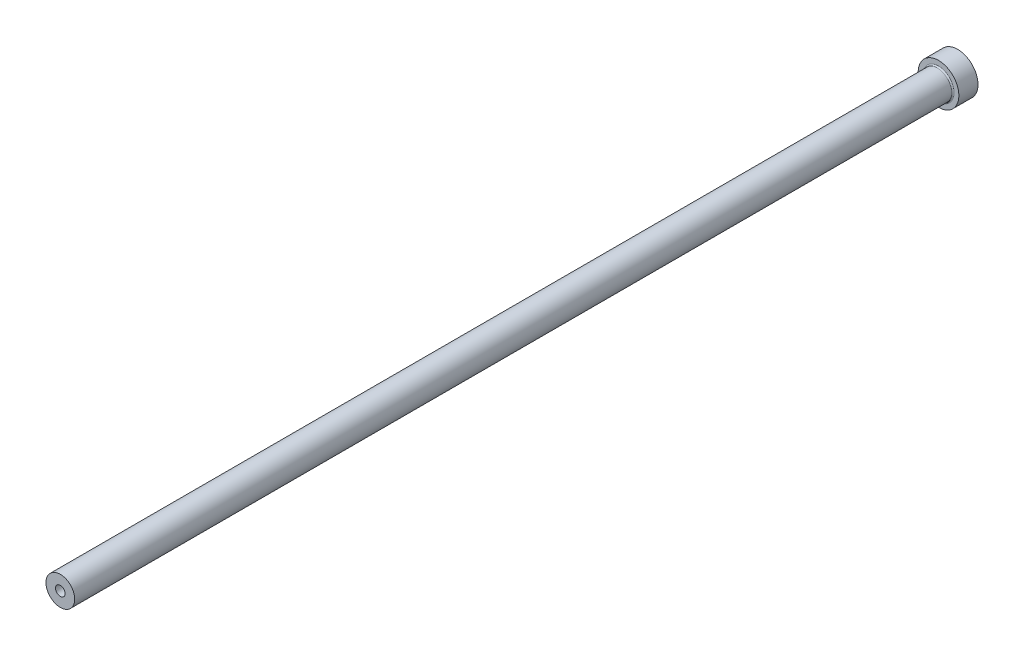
ISO-10303-21;
HEADER;
FILE_DESCRIPTION(('STEP AP214'),'2;1');
FILE_NAME('part.step','',(''),(''),'','','');
FILE_SCHEMA(('AUTOMOTIVE_DESIGN { 1 0 10303 214 1 1 1 1 }'));
ENDSEC;
DATA;
#1=APPLICATION_CONTEXT('core data for automotive mechanical design processes');
#2=APPLICATION_PROTOCOL_DEFINITION('international standard','automotive_design',2000,#1);
#3=PRODUCT_CONTEXT('',#1,'mechanical');
#4=PRODUCT('Part','Part','',(#3));
#5=PRODUCT_RELATED_PRODUCT_CATEGORY('part','',(#4));
#6=PRODUCT_DEFINITION_FORMATION('','',#4);
#7=PRODUCT_DEFINITION_CONTEXT('part definition',#1,'design');
#8=PRODUCT_DEFINITION('design','',#6,#7);
#9=PRODUCT_DEFINITION_SHAPE('','',#8);
#10=(LENGTH_UNIT() NAMED_UNIT(*) SI_UNIT(.MILLI.,.METRE.));
#11=(NAMED_UNIT(*) PLANE_ANGLE_UNIT() SI_UNIT($,.RADIAN.));
#12=(NAMED_UNIT(*) SI_UNIT($,.STERADIAN.) SOLID_ANGLE_UNIT());
#13=UNCERTAINTY_MEASURE_WITH_UNIT(LENGTH_MEASURE(1.E-05),#10,'distance_accuracy_value','');
#14=(GEOMETRIC_REPRESENTATION_CONTEXT(3) GLOBAL_UNCERTAINTY_ASSIGNED_CONTEXT((#13)) GLOBAL_UNIT_ASSIGNED_CONTEXT((#10,
#11,#12)) REPRESENTATION_CONTEXT('',''));
#15=CARTESIAN_POINT('',(0.,0.,0.));
#16=DIRECTION('',(0.,0.,1.));
#17=DIRECTION('',(1.,0.,0.));
#18=AXIS2_PLACEMENT_3D('',#15,#16,#17);
#19=CARTESIAN_POINT('',(0.,0.,375.));
#20=DIRECTION('',(0.,0.,-1.));
#21=DIRECTION('',(-1.,0.,0.));
#22=AXIS2_PLACEMENT_3D('',#19,#20,#21);
#23=PLANE('',#22);
#24=CARTESIAN_POINT('',(0.,0.,375.));
#25=DIRECTION('',(0.,0.,1.));
#26=DIRECTION('',(1.,0.,0.));
#27=AXIS2_PLACEMENT_3D('',#24,#25,#26);
#28=CIRCLE('',#27,1.99999999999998);
#29=CARTESIAN_POINT('',(1.99999999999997,0.,375.));
#30=VERTEX_POINT('',#29);
#31=EDGE_CURVE('E63',#30,#30,#28,.T.);
#32=ORIENTED_EDGE('',*,*,#31,.F.);
#33=EDGE_LOOP('',(#32));
#34=FACE_BOUND('',#33,.T.);
#35=CARTESIAN_POINT('',(0.,0.,375.));
#36=DIRECTION('',(0.,0.,1.));
#37=DIRECTION('',(1.,0.,0.));
#38=AXIS2_PLACEMENT_3D('',#35,#36,#37);
#39=CIRCLE('',#38,5.99999999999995);
#40=CARTESIAN_POINT('',(5.99999999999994,0.,375.));
#41=VERTEX_POINT('',#40);
#42=EDGE_CURVE('E54',#41,#41,#39,.T.);
#43=ORIENTED_EDGE('',*,*,#42,.T.);
#44=EDGE_LOOP('',(#43));
#45=FACE_BOUND('',#44,.T.);
#46=ADVANCED_FACE('F34',(#34,#45),#23,.F.);
#47=CARTESIAN_POINT('',(0.,0.,375.));
#48=DIRECTION('',(0.,0.,1.));
#49=DIRECTION('',(1.,0.,0.));
#50=AXIS2_PLACEMENT_3D('',#47,#48,#49);
#51=CYLINDRICAL_SURFACE('',#50,5.99999999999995);
#52=CARTESIAN_POINT('',(0.,0.,8.50000000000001));
#53=DIRECTION('',(0.,0.,1.));
#54=DIRECTION('',(1.,0.,0.));
#55=AXIS2_PLACEMENT_3D('',#52,#53,#54);
#56=CIRCLE('',#55,5.99999999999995);
#57=CARTESIAN_POINT('',(5.99999999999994,0.,8.50000000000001));
#58=VERTEX_POINT('',#57);
#59=EDGE_CURVE('E49',#58,#58,#56,.T.);
#60=ORIENTED_EDGE('',*,*,#59,.T.);
#61=EDGE_LOOP('',(#60));
#62=FACE_BOUND('',#61,.T.);
#63=ORIENTED_EDGE('',*,*,#42,.F.);
#64=EDGE_LOOP('',(#63));
#65=FACE_BOUND('',#64,.T.);
#66=ADVANCED_FACE('F92',(#62,#65),#51,.T.);
#67=CARTESIAN_POINT('',(0.,0.,8.));
#68=DIRECTION('',(0.,0.,1.));
#69=DIRECTION('',(1.,0.,0.));
#70=AXIS2_PLACEMENT_3D('',#67,#68,#69);
#71=PLANE('',#70);
#72=CARTESIAN_POINT('',(0.,0.,8.));
#73=DIRECTION('',(0.,0.,1.));
#74=DIRECTION('',(1.,0.,0.));
#75=AXIS2_PLACEMENT_3D('',#72,#73,#74);
#76=CIRCLE('',#75,6.49999999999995);
#77=CARTESIAN_POINT('',(6.49999999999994,0.,8.));
#78=VERTEX_POINT('',#77);
#79=EDGE_CURVE('E45',#78,#78,#76,.F.);
#80=ORIENTED_EDGE('',*,*,#79,.T.);
#81=EDGE_LOOP('',(#80));
#82=FACE_BOUND('',#81,.T.);
#83=CARTESIAN_POINT('',(0.,0.,8.00000000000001));
#84=DIRECTION('',(0.,0.,1.));
#85=DIRECTION('',(1.,0.,0.));
#86=AXIS2_PLACEMENT_3D('',#83,#84,#85);
#87=CIRCLE('',#86,8.49999999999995);
#88=CARTESIAN_POINT('',(8.49999999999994,0.,8.00000000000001));
#89=VERTEX_POINT('',#88);
#90=EDGE_CURVE('E57',#89,#89,#87,.T.);
#91=ORIENTED_EDGE('',*,*,#90,.T.);
#92=EDGE_LOOP('',(#91));
#93=FACE_BOUND('',#92,.T.);
#94=ADVANCED_FACE('F98',(#82,#93),#71,.T.);
#95=CARTESIAN_POINT('',(0.,0.,375.));
#96=DIRECTION('',(0.,0.,1.));
#97=DIRECTION('',(1.,0.,0.));
#98=AXIS2_PLACEMENT_3D('',#95,#96,#97);
#99=CYLINDRICAL_SURFACE('',#98,8.49999999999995);
#100=ORIENTED_EDGE('',*,*,#90,.F.);
#101=EDGE_LOOP('',(#100));
#102=FACE_BOUND('',#101,.T.);
#103=CARTESIAN_POINT('',(0.,0.,0.));
#104=DIRECTION('',(0.,0.,1.));
#105=DIRECTION('',(1.,0.,0.));
#106=AXIS2_PLACEMENT_3D('',#103,#104,#105);
#107=CIRCLE('',#106,8.49999999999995);
#108=CARTESIAN_POINT('',(8.49999999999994,0.,0.));
#109=VERTEX_POINT('',#108);
#110=EDGE_CURVE('E60',#109,#109,#107,.T.);
#111=ORIENTED_EDGE('',*,*,#110,.T.);
#112=EDGE_LOOP('',(#111));
#113=FACE_BOUND('',#112,.T.);
#114=ADVANCED_FACE('F89',(#102,#113),#99,.T.);
#115=CARTESIAN_POINT('',(0.,0.,0.));
#116=DIRECTION('',(0.,0.,1.));
#117=DIRECTION('',(1.,0.,0.));
#118=AXIS2_PLACEMENT_3D('',#115,#116,#117);
#119=PLANE('',#118);
#120=CARTESIAN_POINT('',(0.,0.,0.));
#121=DIRECTION('',(0.,0.,1.));
#122=DIRECTION('',(1.,0.,0.));
#123=AXIS2_PLACEMENT_3D('',#120,#121,#122);
#124=CIRCLE('',#123,2.75000000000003);
#125=CARTESIAN_POINT('',(2.74999999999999,0.,0.));
#126=VERTEX_POINT('',#125);
#127=EDGE_CURVE('E41',#126,#126,#124,.T.);
#128=ORIENTED_EDGE('',*,*,#127,.T.);
#129=EDGE_LOOP('',(#128));
#130=FACE_BOUND('',#129,.T.);
#131=ORIENTED_EDGE('',*,*,#110,.F.);
#132=EDGE_LOOP('',(#131));
#133=FACE_BOUND('',#132,.T.);
#134=ADVANCED_FACE('F83',(#130,#133),#119,.F.);
#135=CARTESIAN_POINT('',(0.,0.,375.));
#136=DIRECTION('',(0.,0.,1.));
#137=DIRECTION('',(1.,0.,0.));
#138=AXIS2_PLACEMENT_3D('',#135,#136,#137);
#139=CYLINDRICAL_SURFACE('',#138,1.99999999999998);
#140=ORIENTED_EDGE('',*,*,#31,.T.);
#141=EDGE_LOOP('',(#140));
#142=FACE_BOUND('',#141,.T.);
#143=CARTESIAN_POINT('',(0.,0.,225.));
#144=DIRECTION('',(0.,0.,1.));
#145=DIRECTION('',(1.,0.,0.));
#146=AXIS2_PLACEMENT_3D('',#143,#144,#145);
#147=CIRCLE('',#146,1.99999999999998);
#148=CARTESIAN_POINT('',(1.99999999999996,0.,225.));
#149=VERTEX_POINT('',#148);
#150=EDGE_CURVE('E66',#149,#149,#147,.T.);
#151=ORIENTED_EDGE('',*,*,#150,.F.);
#152=EDGE_LOOP('',(#151));
#153=FACE_BOUND('',#152,.T.);
#154=ADVANCED_FACE('F78',(#142,#153),#139,.F.);
#155=CARTESIAN_POINT('',(0.,0.,225.));
#156=DIRECTION('',(0.,0.,-1.));
#157=DIRECTION('',(-1.,0.,0.));
#158=AXIS2_PLACEMENT_3D('',#155,#156,#157);
#159=CONICAL_SURFACE('',#158,1.99999999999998,0.523598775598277);
#160=CARTESIAN_POINT('',(0.,0.,224.566987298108));
#161=DIRECTION('',(0.,0.,1.));
#162=DIRECTION('',(1.,0.,0.));
#163=AXIS2_PLACEMENT_3D('',#160,#161,#162);
#164=CIRCLE('',#163,2.24999999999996);
#165=CARTESIAN_POINT('',(2.24999999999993,0.,224.566987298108));
#166=VERTEX_POINT('',#165);
#167=EDGE_CURVE('E69',#166,#166,#164,.T.);
#168=ORIENTED_EDGE('',*,*,#167,.F.);
#169=EDGE_LOOP('',(#168));
#170=FACE_BOUND('',#169,.T.);
#171=ORIENTED_EDGE('',*,*,#150,.T.);
#172=EDGE_LOOP('',(#171));
#173=FACE_BOUND('',#172,.T.);
#174=ADVANCED_FACE('F75',(#170,#173),#159,.F.);
#175=CARTESIAN_POINT('',(0.,0.,375.));
#176=DIRECTION('',(0.,0.,1.));
#177=DIRECTION('',(1.,0.,0.));
#178=AXIS2_PLACEMENT_3D('',#175,#176,#177);
#179=CYLINDRICAL_SURFACE('',#178,2.24999999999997);
#180=CARTESIAN_POINT('',(0.,0.,0.500000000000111));
#181=DIRECTION('',(0.,0.,1.));
#182=DIRECTION('',(1.,0.,0.));
#183=AXIS2_PLACEMENT_3D('',#180,#181,#182);
#184=CIRCLE('',#183,2.24999999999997);
#185=CARTESIAN_POINT('',(2.24999999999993,0.,0.500000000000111));
#186=VERTEX_POINT('',#185);
#187=EDGE_CURVE('E10',#186,#186,#184,.F.);
#188=ORIENTED_EDGE('',*,*,#187,.T.);
#189=EDGE_LOOP('',(#188));
#190=FACE_BOUND('',#189,.T.);
#191=ORIENTED_EDGE('',*,*,#167,.T.);
#192=EDGE_LOOP('',(#191));
#193=FACE_BOUND('',#192,.T.);
#194=ADVANCED_FACE('F73',(#190,#193),#179,.F.);
#195=CARTESIAN_POINT('',(0.,0.,8.50000000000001));
#196=DIRECTION('',(0.,0.,1.));
#197=DIRECTION('',(1.,0.,0.));
#198=AXIS2_PLACEMENT_3D('',#195,#196,#197);
#199=TOROIDAL_SURFACE('',#198,6.49999999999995,0.5);
#200=ORIENTED_EDGE('',*,*,#79,.F.);
#201=EDGE_LOOP('',(#200));
#202=FACE_BOUND('',#201,.T.);
#203=ORIENTED_EDGE('',*,*,#59,.F.);
#204=EDGE_LOOP('',(#203));
#205=FACE_BOUND('',#204,.T.);
#206=ADVANCED_FACE('F104',(#202,#205),#199,.F.);
#207=CARTESIAN_POINT('',(0.,0.,0.));
#208=DIRECTION('',(0.,0.,-1.));
#209=DIRECTION('',(-1.,0.,0.));
#210=AXIS2_PLACEMENT_3D('',#207,#208,#209);
#211=CONICAL_SURFACE('',#210,2.75000000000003,0.7853981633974);
#212=ORIENTED_EDGE('',*,*,#187,.F.);
#213=EDGE_LOOP('',(#212));
#214=FACE_BOUND('',#213,.T.);
#215=ORIENTED_EDGE('',*,*,#127,.F.);
#216=EDGE_LOOP('',(#215));
#217=FACE_BOUND('',#216,.T.);
#218=ADVANCED_FACE('F36',(#214,#217),#211,.F.);
#219=CLOSED_SHELL('',(#46,#66,#94,#114,#134,#154,#174,#194,#206,#218));
#220=MANIFOLD_SOLID_BREP('B2',#219);
#221=ADVANCED_BREP_SHAPE_REPRESENTATION('',(#18,#220),#14);
#222=SHAPE_DEFINITION_REPRESENTATION(#9,#221);
ENDSEC;
END-ISO-10303-21;
